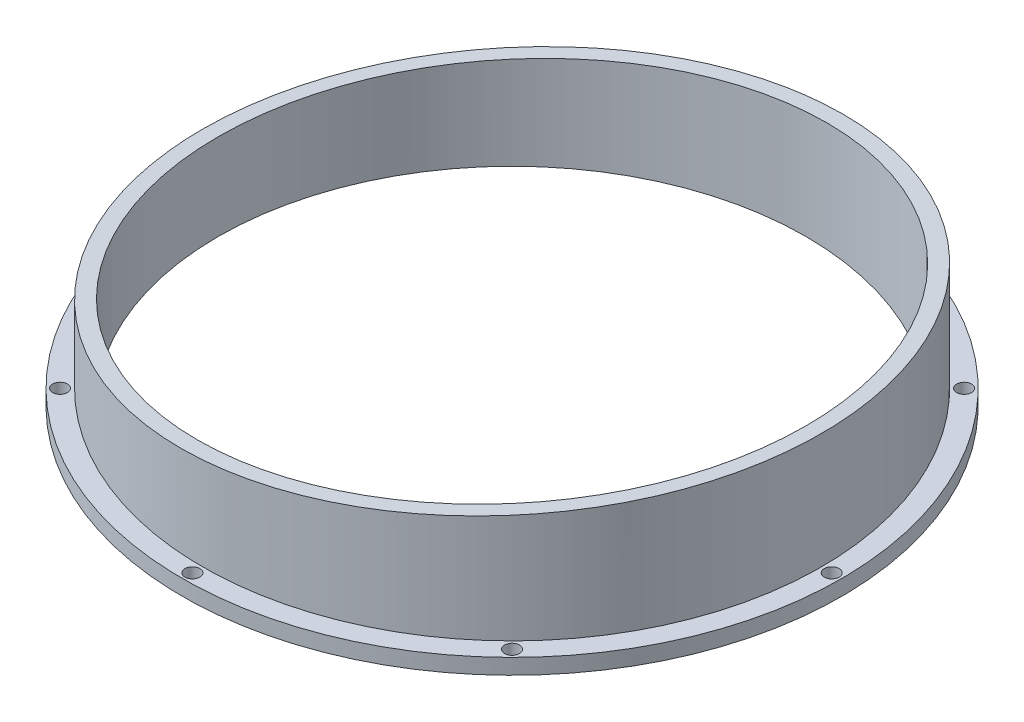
ISO-10303-21;
HEADER;
FILE_DESCRIPTION(('STEP AP214'),'2;1');
FILE_NAME('part.step','',(''),(''),'','','');
FILE_SCHEMA(('AUTOMOTIVE_DESIGN { 1 0 10303 214 1 1 1 1 }'));
ENDSEC;
DATA;
#1=APPLICATION_CONTEXT('core data for automotive mechanical design processes');
#2=APPLICATION_PROTOCOL_DEFINITION('international standard','automotive_design',2000,#1);
#3=PRODUCT_CONTEXT('',#1,'mechanical');
#4=PRODUCT('Part','Part','',(#3));
#5=PRODUCT_RELATED_PRODUCT_CATEGORY('part','',(#4));
#6=PRODUCT_DEFINITION_FORMATION('','',#4);
#7=PRODUCT_DEFINITION_CONTEXT('part definition',#1,'design');
#8=PRODUCT_DEFINITION('design','',#6,#7);
#9=PRODUCT_DEFINITION_SHAPE('','',#8);
#10=(LENGTH_UNIT() NAMED_UNIT(*) SI_UNIT(.MILLI.,.METRE.));
#11=(NAMED_UNIT(*) PLANE_ANGLE_UNIT() SI_UNIT($,.RADIAN.));
#12=(NAMED_UNIT(*) SI_UNIT($,.STERADIAN.) SOLID_ANGLE_UNIT());
#13=UNCERTAINTY_MEASURE_WITH_UNIT(LENGTH_MEASURE(1.E-05),#10,'distance_accuracy_value','');
#14=(GEOMETRIC_REPRESENTATION_CONTEXT(3) GLOBAL_UNCERTAINTY_ASSIGNED_CONTEXT((#13)) GLOBAL_UNIT_ASSIGNED_CONTEXT((#10,
#11,#12)) REPRESENTATION_CONTEXT('',''));
#15=CARTESIAN_POINT('',(0.,0.,0.));
#16=DIRECTION('',(0.,0.,1.));
#17=DIRECTION('',(1.,0.,0.));
#18=AXIS2_PLACEMENT_3D('',#15,#16,#17);
#19=CARTESIAN_POINT('',(0.,25.4,0.));
#20=DIRECTION('',(0.,-1.,0.));
#21=DIRECTION('',(0.,0.,-1.));
#22=AXIS2_PLACEMENT_3D('',#19,#20,#21);
#23=CYLINDRICAL_SURFACE('',#22,50.673);
#24=CARTESIAN_POINT('',(0.,15.1778689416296,0.));
#25=DIRECTION('',(0.0737603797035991,-0.997275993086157,0.));
#26=DIRECTION('',(-0.997275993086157,-0.0737603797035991,0.));
#27=AXIS2_PLACEMENT_3D('',#24,#25,#26);
#28=ELLIPSE('',#27,50.8114106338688,50.673);
#29=CARTESIAN_POINT('',(-50.673,11.43,0.));
#30=VERTEX_POINT('',#29);
#31=EDGE_CURVE('E53',#30,#30,#28,.T.);
#32=ORIENTED_EDGE('',*,*,#31,.T.);
#33=EDGE_LOOP('',(#32));
#34=FACE_BOUND('',#33,.T.);
#35=CARTESIAN_POINT('',(0.,0.,0.));
#36=DIRECTION('',(0.,-1.,0.));
#37=DIRECTION('',(0.,0.,-1.));
#38=AXIS2_PLACEMENT_3D('',#35,#36,#37);
#39=CIRCLE('',#38,50.673);
#40=CARTESIAN_POINT('',(0.,0.,-50.673));
#41=VERTEX_POINT('',#40);
#42=EDGE_CURVE('E10',#41,#41,#39,.T.);
#43=ORIENTED_EDGE('',*,*,#42,.F.);
#44=EDGE_LOOP('',(#43));
#45=FACE_BOUND('',#44,.T.);
#46=ADVANCED_FACE('F34',(#34,#45),#23,.T.);
#47=CARTESIAN_POINT('',(0.,0.,0.));
#48=DIRECTION('',(0.,-1.,0.));
#49=DIRECTION('',(0.,0.,-1.));
#50=AXIS2_PLACEMENT_3D('',#47,#48,#49);
#51=PLANE('',#50);
#52=CARTESIAN_POINT('',(-37.0166157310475,0.,-37.0166157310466));
#53=DIRECTION('',(0.,-1.,0.));
#54=DIRECTION('',(0.,0.,-1.));
#55=AXIS2_PLACEMENT_3D('',#52,#53,#54);
#56=CIRCLE('',#55,1.2192);
#57=CARTESIAN_POINT('',(-37.0166157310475,0.,-38.2358157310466));
#58=VERTEX_POINT('',#57);
#59=EDGE_CURVE('E98',#58,#58,#56,.T.);
#60=ORIENTED_EDGE('',*,*,#59,.T.);
#61=EDGE_LOOP('',(#60));
#62=FACE_BOUND('',#61,.T.);
#63=CARTESIAN_POINT('',(-5.48331177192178E-13,0.,-52.3494));
#64=DIRECTION('',(0.,-1.,0.));
#65=DIRECTION('',(0.,0.,-1.));
#66=AXIS2_PLACEMENT_3D('',#63,#64,#65);
#67=CIRCLE('',#66,1.2192);
#68=CARTESIAN_POINT('',(-5.48331177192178E-13,0.,-53.5686));
#69=VERTEX_POINT('',#68);
#70=EDGE_CURVE('E92',#69,#69,#67,.T.);
#71=ORIENTED_EDGE('',*,*,#70,.T.);
#72=EDGE_LOOP('',(#71));
#73=FACE_BOUND('',#72,.T.);
#74=CARTESIAN_POINT('',(37.0166157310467,0.,-37.0166157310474));
#75=DIRECTION('',(0.,-1.,0.));
#76=DIRECTION('',(0.,0.,-1.));
#77=AXIS2_PLACEMENT_3D('',#74,#75,#76);
#78=CIRCLE('',#77,1.2192);
#79=CARTESIAN_POINT('',(37.0166157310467,0.,-38.2358157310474));
#80=VERTEX_POINT('',#79);
#81=EDGE_CURVE('E86',#80,#80,#78,.T.);
#82=ORIENTED_EDGE('',*,*,#81,.T.);
#83=EDGE_LOOP('',(#82));
#84=FACE_BOUND('',#83,.T.);
#85=CARTESIAN_POINT('',(52.3494,0.,-3.65554118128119E-13));
#86=DIRECTION('',(0.,-1.,0.));
#87=DIRECTION('',(0.,0.,-1.));
#88=AXIS2_PLACEMENT_3D('',#85,#86,#87);
#89=CIRCLE('',#88,1.2192);
#90=CARTESIAN_POINT('',(52.3494,0.,-1.21920000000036));
#91=VERTEX_POINT('',#90);
#92=EDGE_CURVE('E80',#91,#91,#89,.T.);
#93=ORIENTED_EDGE('',*,*,#92,.T.);
#94=EDGE_LOOP('',(#93));
#95=FACE_BOUND('',#94,.T.);
#96=CARTESIAN_POINT('',(37.0166157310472,0.,37.0166157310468));
#97=DIRECTION('',(0.,-1.,0.));
#98=DIRECTION('',(0.,0.,-1.));
#99=AXIS2_PLACEMENT_3D('',#96,#97,#98);
#100=CIRCLE('',#99,1.2192);
#101=CARTESIAN_POINT('',(37.0166157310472,0.,35.7974157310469));
#102=VERTEX_POINT('',#101);
#103=EDGE_CURVE('E74',#102,#102,#100,.T.);
#104=ORIENTED_EDGE('',*,*,#103,.T.);
#105=EDGE_LOOP('',(#104));
#106=FACE_BOUND('',#105,.T.);
#107=CARTESIAN_POINT('',(1.82777059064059E-13,0.,52.3494));
#108=DIRECTION('',(0.,-1.,0.));
#109=DIRECTION('',(0.,0.,-1.));
#110=AXIS2_PLACEMENT_3D('',#107,#108,#109);
#111=CIRCLE('',#110,1.2192);
#112=CARTESIAN_POINT('',(1.82777059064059E-13,0.,51.1302));
#113=VERTEX_POINT('',#112);
#114=EDGE_CURVE('E68',#113,#113,#111,.T.);
#115=ORIENTED_EDGE('',*,*,#114,.T.);
#116=EDGE_LOOP('',(#115));
#117=FACE_BOUND('',#116,.T.);
#118=CARTESIAN_POINT('',(-37.016615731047,0.,37.0166157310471));
#119=DIRECTION('',(0.,-1.,0.));
#120=DIRECTION('',(0.,0.,-1.));
#121=AXIS2_PLACEMENT_3D('',#118,#119,#120);
#122=CIRCLE('',#121,1.2192);
#123=CARTESIAN_POINT('',(-37.016615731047,0.,35.7974157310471));
#124=VERTEX_POINT('',#123);
#125=EDGE_CURVE('E62',#124,#124,#122,.T.);
#126=ORIENTED_EDGE('',*,*,#125,.T.);
#127=EDGE_LOOP('',(#126));
#128=FACE_BOUND('',#127,.T.);
#129=CARTESIAN_POINT('',(-52.3494,0.,0.));
#130=DIRECTION('',(0.,-1.,0.));
#131=DIRECTION('',(0.,0.,-1.));
#132=AXIS2_PLACEMENT_3D('',#129,#130,#131);
#133=CIRCLE('',#132,1.2192);
#134=CARTESIAN_POINT('',(-52.3494,0.,-1.2192));
#135=VERTEX_POINT('',#134);
#136=EDGE_CURVE('E56',#135,#135,#133,.T.);
#137=ORIENTED_EDGE('',*,*,#136,.T.);
#138=EDGE_LOOP('',(#137));
#139=FACE_BOUND('',#138,.T.);
#140=CARTESIAN_POINT('',(0.,0.,0.));
#141=DIRECTION('',(0.,-1.,0.));
#142=DIRECTION('',(0.,0.,-1.));
#143=AXIS2_PLACEMENT_3D('',#140,#141,#142);
#144=CIRCLE('',#143,53.975);
#145=CARTESIAN_POINT('',(0.,0.,-53.975));
#146=VERTEX_POINT('',#145);
#147=EDGE_CURVE('E45',#146,#146,#144,.T.);
#148=ORIENTED_EDGE('',*,*,#147,.F.);
#149=EDGE_LOOP('',(#148));
#150=FACE_BOUND('',#149,.T.);
#151=ORIENTED_EDGE('',*,*,#42,.T.);
#152=EDGE_LOOP('',(#151));
#153=FACE_BOUND('',#152,.T.);
#154=ADVANCED_FACE('F134',(#62,#73,#84,#95,#106,#117,#128,#139,#150,#153),#51,.F.);
#155=CARTESIAN_POINT('',(0.,-2.54,0.));
#156=DIRECTION('',(0.,1.,0.));
#157=DIRECTION('',(0.,0.,1.));
#158=AXIS2_PLACEMENT_3D('',#155,#156,#157);
#159=CYLINDRICAL_SURFACE('',#158,53.975);
#160=CARTESIAN_POINT('',(0.,-2.54,0.));
#161=DIRECTION('',(0.,-1.,0.));
#162=DIRECTION('',(0.,0.,-1.));
#163=AXIS2_PLACEMENT_3D('',#160,#161,#162);
#164=CIRCLE('',#163,53.975);
#165=CARTESIAN_POINT('',(0.,-2.54,-53.975));
#166=VERTEX_POINT('',#165);
#167=EDGE_CURVE('E41',#166,#166,#164,.T.);
#168=ORIENTED_EDGE('',*,*,#167,.F.);
#169=EDGE_LOOP('',(#168));
#170=FACE_BOUND('',#169,.T.);
#171=ORIENTED_EDGE('',*,*,#147,.T.);
#172=EDGE_LOOP('',(#171));
#173=FACE_BOUND('',#172,.T.);
#174=ADVANCED_FACE('F112',(#170,#173),#159,.T.);
#175=CARTESIAN_POINT('',(0.,-2.54,0.));
#176=DIRECTION('',(0.,-1.,0.));
#177=DIRECTION('',(0.,0.,-1.));
#178=AXIS2_PLACEMENT_3D('',#175,#176,#177);
#179=PLANE('',#178);
#180=CARTESIAN_POINT('',(-37.0166157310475,-2.54,-37.0166157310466));
#181=DIRECTION('',(0.,-1.,0.));
#182=DIRECTION('',(0.,0.,-1.));
#183=AXIS2_PLACEMENT_3D('',#180,#181,#182);
#184=CIRCLE('',#183,1.2192);
#185=CARTESIAN_POINT('',(-37.0166157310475,-2.54,-38.2358157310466));
#186=VERTEX_POINT('',#185);
#187=EDGE_CURVE('E101',#186,#186,#184,.T.);
#188=ORIENTED_EDGE('',*,*,#187,.F.);
#189=EDGE_LOOP('',(#188));
#190=FACE_BOUND('',#189,.T.);
#191=CARTESIAN_POINT('',(-5.48331177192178E-13,-2.54,-52.3494));
#192=DIRECTION('',(0.,-1.,0.));
#193=DIRECTION('',(0.,0.,-1.));
#194=AXIS2_PLACEMENT_3D('',#191,#192,#193);
#195=CIRCLE('',#194,1.2192);
#196=CARTESIAN_POINT('',(-5.48331177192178E-13,-2.54,-53.5686));
#197=VERTEX_POINT('',#196);
#198=EDGE_CURVE('E95',#197,#197,#195,.T.);
#199=ORIENTED_EDGE('',*,*,#198,.F.);
#200=EDGE_LOOP('',(#199));
#201=FACE_BOUND('',#200,.T.);
#202=CARTESIAN_POINT('',(37.0166157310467,-2.54,-37.0166157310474));
#203=DIRECTION('',(0.,-1.,0.));
#204=DIRECTION('',(0.,0.,-1.));
#205=AXIS2_PLACEMENT_3D('',#202,#203,#204);
#206=CIRCLE('',#205,1.2192);
#207=CARTESIAN_POINT('',(37.0166157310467,-2.54,-38.2358157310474));
#208=VERTEX_POINT('',#207);
#209=EDGE_CURVE('E89',#208,#208,#206,.T.);
#210=ORIENTED_EDGE('',*,*,#209,.F.);
#211=EDGE_LOOP('',(#210));
#212=FACE_BOUND('',#211,.T.);
#213=CARTESIAN_POINT('',(52.3494,-2.54,-3.65554118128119E-13));
#214=DIRECTION('',(0.,-1.,0.));
#215=DIRECTION('',(0.,0.,-1.));
#216=AXIS2_PLACEMENT_3D('',#213,#214,#215);
#217=CIRCLE('',#216,1.2192);
#218=CARTESIAN_POINT('',(52.3494,-2.54,-1.21920000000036));
#219=VERTEX_POINT('',#218);
#220=EDGE_CURVE('E83',#219,#219,#217,.T.);
#221=ORIENTED_EDGE('',*,*,#220,.F.);
#222=EDGE_LOOP('',(#221));
#223=FACE_BOUND('',#222,.T.);
#224=CARTESIAN_POINT('',(37.0166157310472,-2.54,37.0166157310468));
#225=DIRECTION('',(0.,-1.,0.));
#226=DIRECTION('',(0.,0.,-1.));
#227=AXIS2_PLACEMENT_3D('',#224,#225,#226);
#228=CIRCLE('',#227,1.2192);
#229=CARTESIAN_POINT('',(37.0166157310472,-2.54,35.7974157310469));
#230=VERTEX_POINT('',#229);
#231=EDGE_CURVE('E77',#230,#230,#228,.T.);
#232=ORIENTED_EDGE('',*,*,#231,.F.);
#233=EDGE_LOOP('',(#232));
#234=FACE_BOUND('',#233,.T.);
#235=CARTESIAN_POINT('',(1.82777059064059E-13,-2.54,52.3494));
#236=DIRECTION('',(0.,-1.,0.));
#237=DIRECTION('',(0.,0.,-1.));
#238=AXIS2_PLACEMENT_3D('',#235,#236,#237);
#239=CIRCLE('',#238,1.2192);
#240=CARTESIAN_POINT('',(1.82777059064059E-13,-2.54,51.1302));
#241=VERTEX_POINT('',#240);
#242=EDGE_CURVE('E71',#241,#241,#239,.T.);
#243=ORIENTED_EDGE('',*,*,#242,.F.);
#244=EDGE_LOOP('',(#243));
#245=FACE_BOUND('',#244,.T.);
#246=CARTESIAN_POINT('',(-37.016615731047,-2.54,37.0166157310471));
#247=DIRECTION('',(0.,-1.,0.));
#248=DIRECTION('',(0.,0.,-1.));
#249=AXIS2_PLACEMENT_3D('',#246,#247,#248);
#250=CIRCLE('',#249,1.2192);
#251=CARTESIAN_POINT('',(-37.016615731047,-2.54,35.7974157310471));
#252=VERTEX_POINT('',#251);
#253=EDGE_CURVE('E65',#252,#252,#250,.T.);
#254=ORIENTED_EDGE('',*,*,#253,.F.);
#255=EDGE_LOOP('',(#254));
#256=FACE_BOUND('',#255,.T.);
#257=CARTESIAN_POINT('',(-52.3494,-2.54,0.));
#258=DIRECTION('',(0.,-1.,0.));
#259=DIRECTION('',(0.,0.,-1.));
#260=AXIS2_PLACEMENT_3D('',#257,#258,#259);
#261=CIRCLE('',#260,1.2192);
#262=CARTESIAN_POINT('',(-52.3494,-2.54,-1.2192));
#263=VERTEX_POINT('',#262);
#264=EDGE_CURVE('E59',#263,#263,#261,.T.);
#265=ORIENTED_EDGE('',*,*,#264,.F.);
#266=EDGE_LOOP('',(#265));
#267=FACE_BOUND('',#266,.T.);
#268=CARTESIAN_POINT('',(0.,-2.54,0.));
#269=DIRECTION('',(0.,1.,0.));
#270=DIRECTION('',(0.,0.,1.));
#271=AXIS2_PLACEMENT_3D('',#268,#269,#270);
#272=CIRCLE('',#271,48.133);
#273=CARTESIAN_POINT('',(0.,-2.54,48.133));
#274=VERTEX_POINT('',#273);
#275=EDGE_CURVE('E49',#274,#274,#272,.T.);
#276=ORIENTED_EDGE('',*,*,#275,.T.);
#277=EDGE_LOOP('',(#276));
#278=FACE_BOUND('',#277,.T.);
#279=ORIENTED_EDGE('',*,*,#167,.T.);
#280=EDGE_LOOP('',(#279));
#281=FACE_BOUND('',#280,.T.);
#282=ADVANCED_FACE('F108',(#190,#201,#212,#223,#234,#245,#256,#267,#278,#281),#179,.T.);
#283=CARTESIAN_POINT('',(0.,-2.54,0.));
#284=DIRECTION('',(0.,1.,0.));
#285=DIRECTION('',(0.,0.,1.));
#286=AXIS2_PLACEMENT_3D('',#283,#284,#285);
#287=CYLINDRICAL_SURFACE('',#286,48.133);
#288=CARTESIAN_POINT('',(0.,15.1778689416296,0.));
#289=DIRECTION('',(0.0737603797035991,-0.997275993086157,0.));
#290=DIRECTION('',(0.997275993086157,0.0737603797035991,0.));
#291=AXIS2_PLACEMENT_3D('',#288,#289,#290);
#292=ELLIPSE('',#291,48.2644727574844,48.133);
#293=CARTESIAN_POINT('',(48.133,18.7378747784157,0.));
#294=VERTEX_POINT('',#293);
#295=EDGE_CURVE('E37',#294,#294,#292,.F.);
#296=ORIENTED_EDGE('',*,*,#295,.T.);
#297=EDGE_LOOP('',(#296));
#298=FACE_BOUND('',#297,.T.);
#299=ORIENTED_EDGE('',*,*,#275,.F.);
#300=EDGE_LOOP('',(#299));
#301=FACE_BOUND('',#300,.T.);
#302=ADVANCED_FACE('F111',(#298,#301),#287,.F.);
#303=CARTESIAN_POINT('',(50.673,18.9257378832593,257.341284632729));
#304=DIRECTION('',(0.0737603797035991,-0.997275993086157,0.));
#305=DIRECTION('',(0.997275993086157,0.0737603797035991,0.));
#306=AXIS2_PLACEMENT_3D('',#303,#304,#305);
#307=PLANE('',#306);
#308=ORIENTED_EDGE('',*,*,#295,.F.);
#309=EDGE_LOOP('',(#308));
#310=FACE_BOUND('',#309,.T.);
#311=ORIENTED_EDGE('',*,*,#31,.F.);
#312=EDGE_LOOP('',(#311));
#313=FACE_BOUND('',#312,.T.);
#314=ADVANCED_FACE('F148',(#310,#313),#307,.F.);
#315=CARTESIAN_POINT('',(-52.3494,-2.54,0.));
#316=DIRECTION('',(0.,-1.,0.));
#317=DIRECTION('',(0.,0.,-1.));
#318=AXIS2_PLACEMENT_3D('',#315,#316,#317);
#319=CYLINDRICAL_SURFACE('',#318,1.2192);
#320=ORIENTED_EDGE('',*,*,#264,.T.);
#321=EDGE_LOOP('',(#320));
#322=FACE_BOUND('',#321,.T.);
#323=ORIENTED_EDGE('',*,*,#136,.F.);
#324=EDGE_LOOP('',(#323));
#325=FACE_BOUND('',#324,.T.);
#326=ADVANCED_FACE('F152',(#322,#325),#319,.F.);
#327=CARTESIAN_POINT('',(-37.016615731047,-2.54,37.0166157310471));
#328=DIRECTION('',(0.,-1.,0.));
#329=DIRECTION('',(0.,0.,-1.));
#330=AXIS2_PLACEMENT_3D('',#327,#328,#329);
#331=CYLINDRICAL_SURFACE('',#330,1.2192);
#332=ORIENTED_EDGE('',*,*,#253,.T.);
#333=EDGE_LOOP('',(#332));
#334=FACE_BOUND('',#333,.T.);
#335=ORIENTED_EDGE('',*,*,#125,.F.);
#336=EDGE_LOOP('',(#335));
#337=FACE_BOUND('',#336,.T.);
#338=ADVANCED_FACE('F156',(#334,#337),#331,.F.);
#339=CARTESIAN_POINT('',(1.82777059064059E-13,-2.54,52.3494));
#340=DIRECTION('',(0.,-1.,0.));
#341=DIRECTION('',(0.,0.,-1.));
#342=AXIS2_PLACEMENT_3D('',#339,#340,#341);
#343=CYLINDRICAL_SURFACE('',#342,1.2192);
#344=ORIENTED_EDGE('',*,*,#242,.T.);
#345=EDGE_LOOP('',(#344));
#346=FACE_BOUND('',#345,.T.);
#347=ORIENTED_EDGE('',*,*,#114,.F.);
#348=EDGE_LOOP('',(#347));
#349=FACE_BOUND('',#348,.T.);
#350=ADVANCED_FACE('F160',(#346,#349),#343,.F.);
#351=CARTESIAN_POINT('',(37.0166157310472,-2.54,37.0166157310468));
#352=DIRECTION('',(0.,-1.,0.));
#353=DIRECTION('',(0.,0.,-1.));
#354=AXIS2_PLACEMENT_3D('',#351,#352,#353);
#355=CYLINDRICAL_SURFACE('',#354,1.2192);
#356=ORIENTED_EDGE('',*,*,#231,.T.);
#357=EDGE_LOOP('',(#356));
#358=FACE_BOUND('',#357,.T.);
#359=ORIENTED_EDGE('',*,*,#103,.F.);
#360=EDGE_LOOP('',(#359));
#361=FACE_BOUND('',#360,.T.);
#362=ADVANCED_FACE('F164',(#358,#361),#355,.F.);
#363=CARTESIAN_POINT('',(52.3494,-2.54,-3.65554118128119E-13));
#364=DIRECTION('',(0.,-1.,0.));
#365=DIRECTION('',(0.,0.,-1.));
#366=AXIS2_PLACEMENT_3D('',#363,#364,#365);
#367=CYLINDRICAL_SURFACE('',#366,1.2192);
#368=ORIENTED_EDGE('',*,*,#220,.T.);
#369=EDGE_LOOP('',(#368));
#370=FACE_BOUND('',#369,.T.);
#371=ORIENTED_EDGE('',*,*,#92,.F.);
#372=EDGE_LOOP('',(#371));
#373=FACE_BOUND('',#372,.T.);
#374=ADVANCED_FACE('F168',(#370,#373),#367,.F.);
#375=CARTESIAN_POINT('',(37.0166157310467,-2.54,-37.0166157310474));
#376=DIRECTION('',(0.,-1.,0.));
#377=DIRECTION('',(0.,0.,-1.));
#378=AXIS2_PLACEMENT_3D('',#375,#376,#377);
#379=CYLINDRICAL_SURFACE('',#378,1.2192);
#380=ORIENTED_EDGE('',*,*,#209,.T.);
#381=EDGE_LOOP('',(#380));
#382=FACE_BOUND('',#381,.T.);
#383=ORIENTED_EDGE('',*,*,#81,.F.);
#384=EDGE_LOOP('',(#383));
#385=FACE_BOUND('',#384,.T.);
#386=ADVANCED_FACE('F172',(#382,#385),#379,.F.);
#387=CARTESIAN_POINT('',(-5.48331177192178E-13,-2.54,-52.3494));
#388=DIRECTION('',(0.,-1.,0.));
#389=DIRECTION('',(0.,0.,-1.));
#390=AXIS2_PLACEMENT_3D('',#387,#388,#389);
#391=CYLINDRICAL_SURFACE('',#390,1.2192);
#392=ORIENTED_EDGE('',*,*,#198,.T.);
#393=EDGE_LOOP('',(#392));
#394=FACE_BOUND('',#393,.T.);
#395=ORIENTED_EDGE('',*,*,#70,.F.);
#396=EDGE_LOOP('',(#395));
#397=FACE_BOUND('',#396,.T.);
#398=ADVANCED_FACE('F176',(#394,#397),#391,.F.);
#399=CARTESIAN_POINT('',(-37.0166157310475,-2.54,-37.0166157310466));
#400=DIRECTION('',(0.,-1.,0.));
#401=DIRECTION('',(0.,0.,-1.));
#402=AXIS2_PLACEMENT_3D('',#399,#400,#401);
#403=CYLINDRICAL_SURFACE('',#402,1.2192);
#404=ORIENTED_EDGE('',*,*,#187,.T.);
#405=EDGE_LOOP('',(#404));
#406=FACE_BOUND('',#405,.T.);
#407=ORIENTED_EDGE('',*,*,#59,.F.);
#408=EDGE_LOOP('',(#407));
#409=FACE_BOUND('',#408,.T.);
#410=ADVANCED_FACE('F105',(#406,#409),#403,.F.);
#411=CLOSED_SHELL('',(#46,#154,#174,#282,#302,#314,#326,#338,#350,#362,#374,#386,#398,#410));
#412=MANIFOLD_SOLID_BREP('B2',#411);
#413=ADVANCED_BREP_SHAPE_REPRESENTATION('',(#18,#412),#14);
#414=SHAPE_DEFINITION_REPRESENTATION(#9,#413);
ENDSEC;
END-ISO-10303-21;
